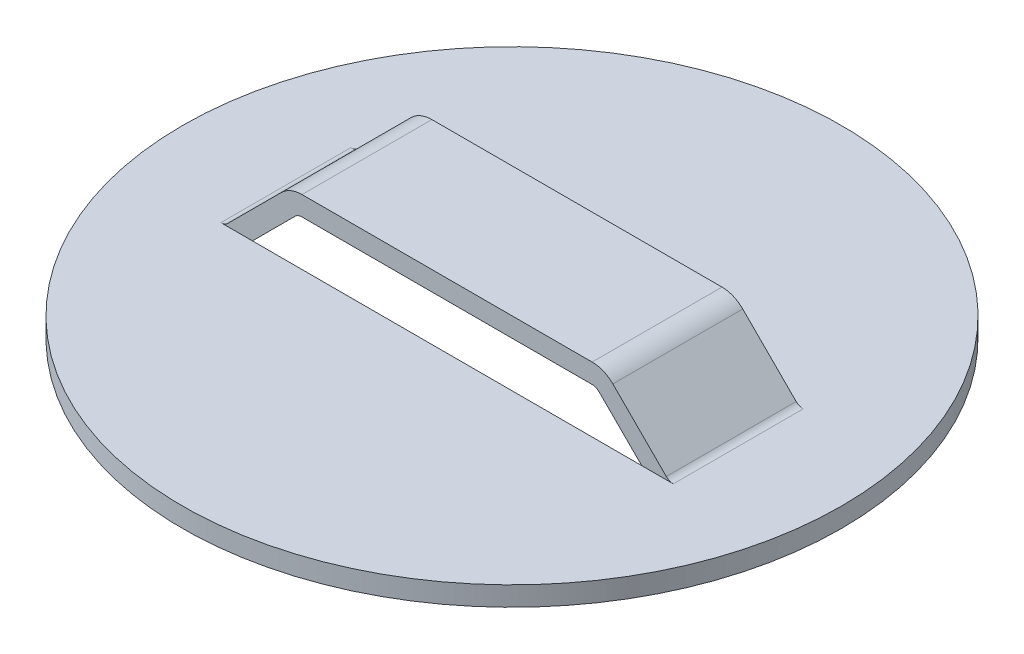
ISO-10303-21;
HEADER;
FILE_DESCRIPTION(('STEP AP214'),'2;1');
FILE_NAME('part.step','',(''),(''),'','','');
FILE_SCHEMA(('AUTOMOTIVE_DESIGN { 1 0 10303 214 1 1 1 1 }'));
ENDSEC;
DATA;
#1=APPLICATION_CONTEXT('core data for automotive mechanical design processes');
#2=APPLICATION_PROTOCOL_DEFINITION('international standard','automotive_design',2000,#1);
#3=PRODUCT_CONTEXT('',#1,'mechanical');
#4=PRODUCT('Part','Part','',(#3));
#5=PRODUCT_RELATED_PRODUCT_CATEGORY('part','',(#4));
#6=PRODUCT_DEFINITION_FORMATION('','',#4);
#7=PRODUCT_DEFINITION_CONTEXT('part definition',#1,'design');
#8=PRODUCT_DEFINITION('design','',#6,#7);
#9=PRODUCT_DEFINITION_SHAPE('','',#8);
#10=(LENGTH_UNIT() NAMED_UNIT(*) SI_UNIT(.MILLI.,.METRE.));
#11=(NAMED_UNIT(*) PLANE_ANGLE_UNIT() SI_UNIT($,.RADIAN.));
#12=(NAMED_UNIT(*) SI_UNIT($,.STERADIAN.) SOLID_ANGLE_UNIT());
#13=UNCERTAINTY_MEASURE_WITH_UNIT(LENGTH_MEASURE(1.E-05),#10,'distance_accuracy_value','');
#14=(GEOMETRIC_REPRESENTATION_CONTEXT(3) GLOBAL_UNCERTAINTY_ASSIGNED_CONTEXT((#13)) GLOBAL_UNIT_ASSIGNED_CONTEXT((#10,
#11,#12)) REPRESENTATION_CONTEXT('',''));
#15=CARTESIAN_POINT('',(0.,0.,0.));
#16=DIRECTION('',(0.,0.,1.));
#17=DIRECTION('',(1.,0.,0.));
#18=AXIS2_PLACEMENT_3D('',#15,#16,#17);
#19=CARTESIAN_POINT('',(-17.4352307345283,0.762,0.));
#20=DIRECTION('',(0.,0.,-1.));
#21=DIRECTION('',(-1.,0.,0.));
#22=AXIS2_PLACEMENT_3D('',#19,#20,#21);
#23=PLANE('',#22);
#24=DIRECTION('',(-1.,0.,0.));
#25=VECTOR('',#24,1.);
#26=CARTESIAN_POINT('',(-17.4352307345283,0.,0.));
#27=LINE('',#26,#25);
#28=CARTESIAN_POINT('',(17.4352307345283,0.,0.));
#29=VERTEX_POINT('',#28);
#30=CARTESIAN_POINT('',(15.0002595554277,0.,0.));
#31=VERTEX_POINT('',#30);
#32=EDGE_CURVE('E165',#29,#31,#27,.T.);
#33=ORIENTED_EDGE('',*,*,#32,.F.);
#34=CARTESIAN_POINT('',(17.4352307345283,0.762,0.));
#35=DIRECTION('',(0.,0.,1.));
#36=DIRECTION('',(1.,0.,0.));
#37=AXIS2_PLACEMENT_3D('',#34,#35,#36);
#38=CIRCLE('',#37,0.761999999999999);
#39=CARTESIAN_POINT('',(16.8964153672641,0.223184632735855,0.));
#40=VERTEX_POINT('',#39);
#41=EDGE_CURVE('E167',#40,#29,#38,.T.);
#42=ORIENTED_EDGE('',*,*,#41,.F.);
#43=DIRECTION('',(0.707106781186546,-0.707106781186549,0.));
#44=VECTOR('',#43,1.);
#45=CARTESIAN_POINT('',(12.7779144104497,4.34168558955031,0.));
#46=LINE('',#45,#44);
#47=CARTESIAN_POINT('',(12.7779144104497,4.34168558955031,0.));
#48=VERTEX_POINT('',#47);
#49=EDGE_CURVE('E185',#48,#40,#46,.T.);
#50=ORIENTED_EDGE('',*,*,#49,.F.);
#51=CARTESIAN_POINT('',(11.1794288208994,2.7432,0.));
#52=DIRECTION('',(0.,0.,1.));
#53=DIRECTION('',(1.,0.,0.));
#54=AXIS2_PLACEMENT_3D('',#51,#52,#53);
#55=CIRCLE('',#54,2.2606);
#56=CARTESIAN_POINT('',(11.1794288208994,5.0038,0.));
#57=VERTEX_POINT('',#56);
#58=EDGE_CURVE('E201',#57,#48,#55,.F.);
#59=ORIENTED_EDGE('',*,*,#58,.F.);
#60=DIRECTION('',(1.,0.,0.));
#61=VECTOR('',#60,1.);
#62=CARTESIAN_POINT('',(-11.1794288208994,5.0038,0.));
#63=LINE('',#62,#61);
#64=CARTESIAN_POINT('',(-11.1794288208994,5.0038,0.));
#65=VERTEX_POINT('',#64);
#66=EDGE_CURVE('E270',#65,#57,#63,.T.);
#67=ORIENTED_EDGE('',*,*,#66,.F.);
#68=CARTESIAN_POINT('',(-11.1794288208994,2.7432,0.));
#69=DIRECTION('',(0.,0.,1.));
#70=DIRECTION('',(1.,0.,0.));
#71=AXIS2_PLACEMENT_3D('',#68,#69,#70);
#72=CIRCLE('',#71,2.2606);
#73=CARTESIAN_POINT('',(-12.7779144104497,4.34168558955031,0.));
#74=VERTEX_POINT('',#73);
#75=EDGE_CURVE('E214',#74,#65,#72,.F.);
#76=ORIENTED_EDGE('',*,*,#75,.F.);
#77=DIRECTION('',(0.707106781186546,0.707106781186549,0.));
#78=VECTOR('',#77,1.);
#79=CARTESIAN_POINT('',(-16.8964153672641,0.223184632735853,0.));
#80=LINE('',#79,#78);
#81=CARTESIAN_POINT('',(-16.8964153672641,0.223184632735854,0.));
#82=VERTEX_POINT('',#81);
#83=EDGE_CURVE('E256',#82,#74,#80,.T.);
#84=ORIENTED_EDGE('',*,*,#83,.F.);
#85=CARTESIAN_POINT('',(-17.4352307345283,0.762,0.));
#86=DIRECTION('',(0.,0.,1.));
#87=DIRECTION('',(1.,0.,0.));
#88=AXIS2_PLACEMENT_3D('',#85,#86,#87);
#89=CIRCLE('',#88,0.761999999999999);
#90=CARTESIAN_POINT('',(-17.4352307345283,0.,0.));
#91=VERTEX_POINT('',#90);
#92=EDGE_CURVE('E205',#91,#82,#89,.T.);
#93=ORIENTED_EDGE('',*,*,#92,.F.);
#94=CARTESIAN_POINT('',(-15.0002595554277,0.,0.));
#95=VERTEX_POINT('',#94);
#96=EDGE_CURVE('E177',#95,#91,#27,.T.);
#97=ORIENTED_EDGE('',*,*,#96,.F.);
#98=DIRECTION('',(-0.707106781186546,-0.707106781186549,0.));
#99=VECTOR('',#98,1.);
#100=CARTESIAN_POINT('',(-11.7182441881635,3.28201536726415,0.));
#101=LINE('',#100,#99);
#102=CARTESIAN_POINT('',(-11.7182441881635,3.28201536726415,0.));
#103=VERTEX_POINT('',#102);
#104=EDGE_CURVE('E247',#103,#95,#101,.T.);
#105=ORIENTED_EDGE('',*,*,#104,.F.);
#106=CARTESIAN_POINT('',(-11.1794288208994,2.7432,0.));
#107=DIRECTION('',(0.,0.,1.));
#108=DIRECTION('',(1.,0.,0.));
#109=AXIS2_PLACEMENT_3D('',#106,#107,#108);
#110=CIRCLE('',#109,0.761999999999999);
#111=CARTESIAN_POINT('',(-11.1794288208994,3.5052,0.));
#112=VERTEX_POINT('',#111);
#113=EDGE_CURVE('E248',#112,#103,#110,.T.);
#114=ORIENTED_EDGE('',*,*,#113,.F.);
#115=DIRECTION('',(-1.,0.,0.));
#116=VECTOR('',#115,1.);
#117=CARTESIAN_POINT('',(-17.4352307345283,3.5052,0.));
#118=LINE('',#117,#116);
#119=CARTESIAN_POINT('',(11.1794288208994,3.5052,0.));
#120=VERTEX_POINT('',#119);
#121=EDGE_CURVE('E251',#120,#112,#118,.T.);
#122=ORIENTED_EDGE('',*,*,#121,.F.);
#123=CARTESIAN_POINT('',(11.1794288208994,2.7432,0.));
#124=DIRECTION('',(0.,0.,1.));
#125=DIRECTION('',(1.,0.,0.));
#126=AXIS2_PLACEMENT_3D('',#123,#124,#125);
#127=CIRCLE('',#126,0.761999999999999);
#128=CARTESIAN_POINT('',(11.7182441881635,3.28201536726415,0.));
#129=VERTEX_POINT('',#128);
#130=EDGE_CURVE('E252',#129,#120,#127,.T.);
#131=ORIENTED_EDGE('',*,*,#130,.F.);
#132=DIRECTION('',(-0.707106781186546,0.707106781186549,0.));
#133=VECTOR('',#132,1.);
#134=CARTESIAN_POINT('',(15.836745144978,-0.836485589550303,0.));
#135=LINE('',#134,#133);
#136=EDGE_CURVE('E169',#31,#129,#135,.T.);
#137=ORIENTED_EDGE('',*,*,#136,.F.);
#138=EDGE_LOOP('',(#33,#42,#50,#59,#67,#76,#84,#93,#97,#105,#114,#122,#131,#137));
#139=FACE_BOUND('',#138,.T.);
#140=ADVANCED_FACE('F39',(#139),#23,.F.);
#141=CARTESIAN_POINT('',(-17.4352307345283,0.762,-10.0076));
#142=DIRECTION('',(0.,0.,-1.));
#143=DIRECTION('',(-1.,0.,0.));
#144=AXIS2_PLACEMENT_3D('',#141,#142,#143);
#145=PLANE('',#144);
#146=CARTESIAN_POINT('',(17.4352307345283,0.762,-10.0076));
#147=DIRECTION('',(0.,0.,1.));
#148=DIRECTION('',(1.,0.,0.));
#149=AXIS2_PLACEMENT_3D('',#146,#147,#148);
#150=CIRCLE('',#149,0.761999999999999);
#151=CARTESIAN_POINT('',(16.8964153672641,0.223184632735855,-10.0076));
#152=VERTEX_POINT('',#151);
#153=CARTESIAN_POINT('',(17.4352307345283,0.,-10.0076));
#154=VERTEX_POINT('',#153);
#155=EDGE_CURVE('E233',#152,#154,#150,.T.);
#156=ORIENTED_EDGE('',*,*,#155,.T.);
#157=DIRECTION('',(-1.,0.,0.));
#158=VECTOR('',#157,1.);
#159=CARTESIAN_POINT('',(-17.4352307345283,0.,-10.0076));
#160=LINE('',#159,#158);
#161=CARTESIAN_POINT('',(15.0002595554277,0.,-10.0076));
#162=VERTEX_POINT('',#161);
#163=EDGE_CURVE('E11',#154,#162,#160,.T.);
#164=ORIENTED_EDGE('',*,*,#163,.T.);
#165=DIRECTION('',(-0.707106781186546,0.707106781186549,0.));
#166=VECTOR('',#165,1.);
#167=CARTESIAN_POINT('',(15.836745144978,-0.836485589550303,-10.0076));
#168=LINE('',#167,#166);
#169=CARTESIAN_POINT('',(11.7182441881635,3.28201536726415,-10.0076));
#170=VERTEX_POINT('',#169);
#171=EDGE_CURVE('E232',#162,#170,#168,.T.);
#172=ORIENTED_EDGE('',*,*,#171,.T.);
#173=CARTESIAN_POINT('',(11.1794288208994,2.7432,-10.0076));
#174=DIRECTION('',(0.,0.,1.));
#175=DIRECTION('',(1.,0.,0.));
#176=AXIS2_PLACEMENT_3D('',#173,#174,#175);
#177=CIRCLE('',#176,0.761999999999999);
#178=CARTESIAN_POINT('',(11.1794288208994,3.5052,-10.0076));
#179=VERTEX_POINT('',#178);
#180=EDGE_CURVE('E225',#170,#179,#177,.T.);
#181=ORIENTED_EDGE('',*,*,#180,.T.);
#182=DIRECTION('',(-1.,0.,0.));
#183=VECTOR('',#182,1.);
#184=CARTESIAN_POINT('',(-17.4352307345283,3.5052,-10.0076));
#185=LINE('',#184,#183);
#186=CARTESIAN_POINT('',(-11.1794288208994,3.5052,-10.0076));
#187=VERTEX_POINT('',#186);
#188=EDGE_CURVE('E224',#179,#187,#185,.T.);
#189=ORIENTED_EDGE('',*,*,#188,.T.);
#190=CARTESIAN_POINT('',(-11.1794288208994,2.7432,-10.0076));
#191=DIRECTION('',(0.,0.,1.));
#192=DIRECTION('',(1.,0.,0.));
#193=AXIS2_PLACEMENT_3D('',#190,#191,#192);
#194=CIRCLE('',#193,0.761999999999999);
#195=CARTESIAN_POINT('',(-11.7182441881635,3.28201536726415,-10.0076));
#196=VERTEX_POINT('',#195);
#197=EDGE_CURVE('E221',#187,#196,#194,.T.);
#198=ORIENTED_EDGE('',*,*,#197,.T.);
#199=DIRECTION('',(-0.707106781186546,-0.707106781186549,0.));
#200=VECTOR('',#199,1.);
#201=CARTESIAN_POINT('',(-11.7182441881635,3.28201536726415,-10.0076));
#202=LINE('',#201,#200);
#203=CARTESIAN_POINT('',(-15.0002595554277,0.,-10.0076));
#204=VERTEX_POINT('',#203);
#205=EDGE_CURVE('E220',#196,#204,#202,.T.);
#206=ORIENTED_EDGE('',*,*,#205,.T.);
#207=DIRECTION('',(1.,0.,0.));
#208=VECTOR('',#207,1.);
#209=CARTESIAN_POINT('',(-17.4352307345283,0.,-10.0076));
#210=LINE('',#209,#208);
#211=CARTESIAN_POINT('',(-17.4352307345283,0.,-10.0076));
#212=VERTEX_POINT('',#211);
#213=EDGE_CURVE('E322',#212,#204,#210,.T.);
#214=ORIENTED_EDGE('',*,*,#213,.F.);
#215=CARTESIAN_POINT('',(-17.4352307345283,0.762,-10.0076));
#216=DIRECTION('',(0.,0.,1.));
#217=DIRECTION('',(1.,0.,0.));
#218=AXIS2_PLACEMENT_3D('',#215,#216,#217);
#219=CIRCLE('',#218,0.761999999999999);
#220=CARTESIAN_POINT('',(-16.8964153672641,0.223184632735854,-10.0076));
#221=VERTEX_POINT('',#220);
#222=EDGE_CURVE('E200',#212,#221,#219,.T.);
#223=ORIENTED_EDGE('',*,*,#222,.T.);
#224=DIRECTION('',(0.707106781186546,0.707106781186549,0.));
#225=VECTOR('',#224,1.);
#226=CARTESIAN_POINT('',(-16.8964153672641,0.223184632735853,-10.0076));
#227=LINE('',#226,#225);
#228=CARTESIAN_POINT('',(-12.7779144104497,4.34168558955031,-10.0076));
#229=VERTEX_POINT('',#228);
#230=EDGE_CURVE('E239',#221,#229,#227,.T.);
#231=ORIENTED_EDGE('',*,*,#230,.T.);
#232=CARTESIAN_POINT('',(-11.1794288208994,2.7432,-10.0076));
#233=DIRECTION('',(0.,0.,1.));
#234=DIRECTION('',(1.,0.,0.));
#235=AXIS2_PLACEMENT_3D('',#232,#233,#234);
#236=CIRCLE('',#235,2.2606);
#237=CARTESIAN_POINT('',(-11.1794288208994,5.0038,-10.0076));
#238=VERTEX_POINT('',#237);
#239=EDGE_CURVE('E210',#238,#229,#236,.T.);
#240=ORIENTED_EDGE('',*,*,#239,.F.);
#241=DIRECTION('',(1.,0.,0.));
#242=VECTOR('',#241,1.);
#243=CARTESIAN_POINT('',(-11.1794288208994,5.0038,-10.0076));
#244=LINE('',#243,#242);
#245=CARTESIAN_POINT('',(11.1794288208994,5.0038,-10.0076));
#246=VERTEX_POINT('',#245);
#247=EDGE_CURVE('E307',#246,#238,#244,.F.);
#248=ORIENTED_EDGE('',*,*,#247,.F.);
#249=CARTESIAN_POINT('',(11.1794288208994,2.7432,-10.0076));
#250=DIRECTION('',(0.,0.,1.));
#251=DIRECTION('',(1.,0.,0.));
#252=AXIS2_PLACEMENT_3D('',#249,#250,#251);
#253=CIRCLE('',#252,2.2606);
#254=CARTESIAN_POINT('',(12.7779144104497,4.34168558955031,-10.0076));
#255=VERTEX_POINT('',#254);
#256=EDGE_CURVE('E236',#246,#255,#253,.F.);
#257=ORIENTED_EDGE('',*,*,#256,.T.);
#258=DIRECTION('',(0.707106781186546,-0.707106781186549,0.));
#259=VECTOR('',#258,1.);
#260=CARTESIAN_POINT('',(12.7779144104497,4.34168558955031,-10.0076));
#261=LINE('',#260,#259);
#262=EDGE_CURVE('E235',#255,#152,#261,.T.);
#263=ORIENTED_EDGE('',*,*,#262,.T.);
#264=EDGE_LOOP('',(#156,#164,#172,#181,#189,#198,#206,#214,#223,#231,#240,#248,#257,#263));
#265=FACE_BOUND('',#264,.T.);
#266=ADVANCED_FACE('F347',(#265),#145,.T.);
#267=CARTESIAN_POINT('',(-17.4352307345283,0.762,-10.0076));
#268=DIRECTION('',(0.,0.,1.));
#269=DIRECTION('',(1.,0.,0.));
#270=AXIS2_PLACEMENT_3D('',#267,#268,#269);
#271=CYLINDRICAL_SURFACE('',#270,0.761999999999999);
#272=DIRECTION('',(0.,0.,1.));
#273=VECTOR('',#272,1.);
#274=CARTESIAN_POINT('',(-16.8964153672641,0.223184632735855,-10.0076));
#275=LINE('',#274,#273);
#276=EDGE_CURVE('E202',#221,#82,#275,.T.);
#277=ORIENTED_EDGE('',*,*,#276,.F.);
#278=ORIENTED_EDGE('',*,*,#222,.F.);
#279=DIRECTION('',(0.,0.,1.));
#280=VECTOR('',#279,1.);
#281=CARTESIAN_POINT('',(-17.4352307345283,0.,-10.0076));
#282=LINE('',#281,#280);
#283=EDGE_CURVE('E194',#91,#212,#282,.F.);
#284=ORIENTED_EDGE('',*,*,#283,.F.);
#285=ORIENTED_EDGE('',*,*,#92,.T.);
#286=EDGE_LOOP('',(#277,#278,#284,#285));
#287=FACE_BOUND('',#286,.T.);
#288=ADVANCED_FACE('F41',(#287),#271,.F.);
#289=CARTESIAN_POINT('',(12.7779144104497,4.34168558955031,-10.0076));
#290=DIRECTION('',(0.707106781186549,0.707106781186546,0.));
#291=DIRECTION('',(-0.707106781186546,0.707106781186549,0.));
#292=AXIS2_PLACEMENT_3D('',#289,#290,#291);
#293=PLANE('',#292);
#294=ORIENTED_EDGE('',*,*,#262,.F.);
#295=DIRECTION('',(0.,0.,1.));
#296=VECTOR('',#295,1.);
#297=CARTESIAN_POINT('',(12.7779144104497,4.34168558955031,-10.0076));
#298=LINE('',#297,#296);
#299=EDGE_CURVE('E198',#48,#255,#298,.F.);
#300=ORIENTED_EDGE('',*,*,#299,.F.);
#301=ORIENTED_EDGE('',*,*,#49,.T.);
#302=DIRECTION('',(0.,0.,1.));
#303=VECTOR('',#302,1.);
#304=CARTESIAN_POINT('',(16.8964153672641,0.223184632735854,-10.0076));
#305=LINE('',#304,#303);
#306=EDGE_CURVE('E183',#40,#152,#305,.F.);
#307=ORIENTED_EDGE('',*,*,#306,.T.);
#308=EDGE_LOOP('',(#294,#300,#301,#307));
#309=FACE_BOUND('',#308,.T.);
#310=ADVANCED_FACE('F502',(#309),#293,.T.);
#311=CARTESIAN_POINT('',(17.4352307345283,0.762,-10.0076));
#312=DIRECTION('',(0.,0.,1.));
#313=DIRECTION('',(1.,0.,0.));
#314=AXIS2_PLACEMENT_3D('',#311,#312,#313);
#315=CYLINDRICAL_SURFACE('',#314,0.761999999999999);
#316=DIRECTION('',(0.,0.,1.));
#317=VECTOR('',#316,1.);
#318=CARTESIAN_POINT('',(17.4352307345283,0.,-10.0076));
#319=LINE('',#318,#317);
#320=EDGE_CURVE('E182',#154,#29,#319,.T.);
#321=ORIENTED_EDGE('',*,*,#320,.F.);
#322=ORIENTED_EDGE('',*,*,#155,.F.);
#323=ORIENTED_EDGE('',*,*,#306,.F.);
#324=ORIENTED_EDGE('',*,*,#41,.T.);
#325=EDGE_LOOP('',(#321,#322,#323,#324));
#326=FACE_BOUND('',#325,.T.);
#327=ADVANCED_FACE('F180',(#326),#315,.F.);
#328=CARTESIAN_POINT('',(17.4352307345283,0.,-10.0076));
#329=DIRECTION('',(0.,1.,0.));
#330=DIRECTION('',(0.,0.,1.));
#331=AXIS2_PLACEMENT_3D('',#328,#329,#330);
#332=PLANE('',#331);
#333=CARTESIAN_POINT('',(0.,0.,-5.0038));
#334=DIRECTION('',(0.,-1.,0.));
#335=DIRECTION('',(1.,0.,0.));
#336=AXIS2_PLACEMENT_3D('',#333,#334,#335);
#337=CIRCLE('',#336,25.4);
#338=CARTESIAN_POINT('',(25.4,0.,-5.0038));
#339=VERTEX_POINT('',#338);
#340=EDGE_CURVE('E209',#339,#339,#337,.T.);
#341=ORIENTED_EDGE('',*,*,#340,.F.);
#342=EDGE_LOOP('',(#341));
#343=FACE_BOUND('',#342,.T.);
#344=ORIENTED_EDGE('',*,*,#320,.T.);
#345=ORIENTED_EDGE('',*,*,#32,.T.);
#346=EDGE_CURVE('E175',#31,#95,#27,.T.);
#347=ORIENTED_EDGE('',*,*,#346,.T.);
#348=ORIENTED_EDGE('',*,*,#96,.T.);
#349=ORIENTED_EDGE('',*,*,#283,.T.);
#350=ORIENTED_EDGE('',*,*,#213,.T.);
#351=EDGE_CURVE('E174',#204,#162,#210,.T.);
#352=ORIENTED_EDGE('',*,*,#351,.T.);
#353=ORIENTED_EDGE('',*,*,#163,.F.);
#354=EDGE_LOOP('',(#344,#345,#347,#348,#349,#350,#352,#353));
#355=FACE_BOUND('',#354,.T.);
#356=ADVANCED_FACE('F187',(#343,#355),#332,.T.);
#357=CARTESIAN_POINT('',(17.4352307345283,0.762,-10.0076));
#358=DIRECTION('',(0.,0.,1.));
#359=DIRECTION('',(1.,0.,0.));
#360=AXIS2_PLACEMENT_3D('',#357,#358,#359);
#361=CYLINDRICAL_SURFACE('',#360,2.2606);
#362=CARTESIAN_POINT('',(17.4352307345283,0.762,-10.0076));
#363=DIRECTION('',(0.,0.,1.));
#364=DIRECTION('',(1.,0.,0.));
#365=AXIS2_PLACEMENT_3D('',#362,#363,#364);
#366=CIRCLE('',#365,2.2606);
#367=CARTESIAN_POINT('',(17.4352307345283,-1.4986,-10.0076));
#368=VERTEX_POINT('',#367);
#369=CARTESIAN_POINT('',(15.836745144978,-0.836485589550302,-10.0076));
#370=VERTEX_POINT('',#369);
#371=EDGE_CURVE('E229',#368,#370,#366,.F.);
#372=ORIENTED_EDGE('',*,*,#371,.F.);
#373=DIRECTION('',(0.,0.,1.));
#374=VECTOR('',#373,1.);
#375=CARTESIAN_POINT('',(17.4352307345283,-1.4986,-10.0076));
#376=LINE('',#375,#374);
#377=CARTESIAN_POINT('',(17.4352307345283,-1.4986,0.));
#378=VERTEX_POINT('',#377);
#379=EDGE_CURVE('E189',#368,#378,#376,.T.);
#380=ORIENTED_EDGE('',*,*,#379,.T.);
#381=CARTESIAN_POINT('',(17.4352307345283,0.762,0.));
#382=DIRECTION('',(0.,0.,1.));
#383=DIRECTION('',(1.,0.,0.));
#384=AXIS2_PLACEMENT_3D('',#381,#382,#383);
#385=CIRCLE('',#384,2.2606);
#386=CARTESIAN_POINT('',(15.836745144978,-0.836485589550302,0.));
#387=VERTEX_POINT('',#386);
#388=EDGE_CURVE('E184',#378,#387,#385,.F.);
#389=ORIENTED_EDGE('',*,*,#388,.T.);
#390=DIRECTION('',(0.,0.,1.));
#391=VECTOR('',#390,1.);
#392=CARTESIAN_POINT('',(15.836745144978,-0.836485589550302,-10.0076));
#393=LINE('',#392,#391);
#394=EDGE_CURVE('E192',#370,#387,#393,.T.);
#395=ORIENTED_EDGE('',*,*,#394,.F.);
#396=EDGE_LOOP('',(#372,#380,#389,#395));
#397=FACE_BOUND('',#396,.T.);
#398=ADVANCED_FACE('F292',(#397),#361,.T.);
#399=CARTESIAN_POINT('',(11.7182441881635,3.28201536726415,-10.0076));
#400=DIRECTION('',(-0.707106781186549,-0.707106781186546,0.));
#401=DIRECTION('',(0.707106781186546,-0.707106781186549,0.));
#402=AXIS2_PLACEMENT_3D('',#399,#400,#401);
#403=PLANE('',#402);
#404=EDGE_CURVE('E228',#370,#162,#168,.T.);
#405=ORIENTED_EDGE('',*,*,#404,.F.);
#406=ORIENTED_EDGE('',*,*,#394,.T.);
#407=EDGE_CURVE('E254',#387,#31,#135,.T.);
#408=ORIENTED_EDGE('',*,*,#407,.T.);
#409=ORIENTED_EDGE('',*,*,#136,.T.);
#410=DIRECTION('',(0.,0.,1.));
#411=VECTOR('',#410,1.);
#412=CARTESIAN_POINT('',(11.7182441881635,3.28201536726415,-10.0076));
#413=LINE('',#412,#411);
#414=EDGE_CURVE('E284',#129,#170,#413,.F.);
#415=ORIENTED_EDGE('',*,*,#414,.T.);
#416=ORIENTED_EDGE('',*,*,#171,.F.);
#417=EDGE_LOOP('',(#405,#406,#408,#409,#415,#416));
#418=FACE_BOUND('',#417,.T.);
#419=ADVANCED_FACE('F289',(#418),#403,.T.);
#420=CARTESIAN_POINT('',(11.1794288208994,2.7432,-10.0076));
#421=DIRECTION('',(0.,0.,1.));
#422=DIRECTION('',(1.,0.,0.));
#423=AXIS2_PLACEMENT_3D('',#420,#421,#422);
#424=CYLINDRICAL_SURFACE('',#423,0.761999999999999);
#425=DIRECTION('',(0.,0.,-1.));
#426=VECTOR('',#425,1.);
#427=CARTESIAN_POINT('',(11.1794288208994,3.5052,-10.0076));
#428=LINE('',#427,#426);
#429=EDGE_CURVE('E281',#179,#120,#428,.F.);
#430=ORIENTED_EDGE('',*,*,#429,.F.);
#431=ORIENTED_EDGE('',*,*,#180,.F.);
#432=ORIENTED_EDGE('',*,*,#414,.F.);
#433=ORIENTED_EDGE('',*,*,#130,.T.);
#434=EDGE_LOOP('',(#430,#431,#432,#433));
#435=FACE_BOUND('',#434,.T.);
#436=ADVANCED_FACE('F357',(#435),#424,.F.);
#437=CARTESIAN_POINT('',(-11.1794288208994,3.5052,-10.0076));
#438=DIRECTION('',(0.,-1.,0.));
#439=DIRECTION('',(0.,0.,-1.));
#440=AXIS2_PLACEMENT_3D('',#437,#438,#439);
#441=PLANE('',#440);
#442=ORIENTED_EDGE('',*,*,#188,.F.);
#443=ORIENTED_EDGE('',*,*,#429,.T.);
#444=ORIENTED_EDGE('',*,*,#121,.T.);
#445=DIRECTION('',(0.,0.,1.));
#446=VECTOR('',#445,1.);
#447=CARTESIAN_POINT('',(-11.1794288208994,3.5052,-10.0076));
#448=LINE('',#447,#446);
#449=EDGE_CURVE('E279',#112,#187,#448,.F.);
#450=ORIENTED_EDGE('',*,*,#449,.T.);
#451=EDGE_LOOP('',(#442,#443,#444,#450));
#452=FACE_BOUND('',#451,.T.);
#453=ADVANCED_FACE('F354',(#452),#441,.T.);
#454=CARTESIAN_POINT('',(-11.1794288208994,2.7432,-10.0076));
#455=DIRECTION('',(0.,0.,1.));
#456=DIRECTION('',(1.,0.,0.));
#457=AXIS2_PLACEMENT_3D('',#454,#455,#456);
#458=CYLINDRICAL_SURFACE('',#457,0.761999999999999);
#459=DIRECTION('',(0.,0.,1.));
#460=VECTOR('',#459,1.);
#461=CARTESIAN_POINT('',(-11.7182441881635,3.28201536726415,-10.0076));
#462=LINE('',#461,#460);
#463=EDGE_CURVE('E276',#196,#103,#462,.T.);
#464=ORIENTED_EDGE('',*,*,#463,.F.);
#465=ORIENTED_EDGE('',*,*,#197,.F.);
#466=ORIENTED_EDGE('',*,*,#449,.F.);
#467=ORIENTED_EDGE('',*,*,#113,.T.);
#468=EDGE_LOOP('',(#464,#465,#466,#467));
#469=FACE_BOUND('',#468,.T.);
#470=ADVANCED_FACE('F352',(#469),#458,.F.);
#471=CARTESIAN_POINT('',(-15.836745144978,-0.836485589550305,-10.0076));
#472=DIRECTION('',(0.70710678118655,-0.707106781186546,0.));
#473=DIRECTION('',(0.707106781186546,0.70710678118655,0.));
#474=AXIS2_PLACEMENT_3D('',#471,#472,#473);
#475=PLANE('',#474);
#476=ORIENTED_EDGE('',*,*,#205,.F.);
#477=ORIENTED_EDGE('',*,*,#463,.T.);
#478=ORIENTED_EDGE('',*,*,#104,.T.);
#479=CARTESIAN_POINT('',(-15.836745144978,-0.836485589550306,0.));
#480=VERTEX_POINT('',#479);
#481=EDGE_CURVE('E250',#95,#480,#101,.T.);
#482=ORIENTED_EDGE('',*,*,#481,.T.);
#483=DIRECTION('',(0.,0.,1.));
#484=VECTOR('',#483,1.);
#485=CARTESIAN_POINT('',(-15.836745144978,-0.836485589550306,-10.0076));
#486=LINE('',#485,#484);
#487=CARTESIAN_POINT('',(-15.836745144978,-0.836485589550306,-10.0076));
#488=VERTEX_POINT('',#487);
#489=EDGE_CURVE('E273',#488,#480,#486,.T.);
#490=ORIENTED_EDGE('',*,*,#489,.F.);
#491=EDGE_CURVE('E54',#204,#488,#202,.T.);
#492=ORIENTED_EDGE('',*,*,#491,.F.);
#493=EDGE_LOOP('',(#476,#477,#478,#482,#490,#492));
#494=FACE_BOUND('',#493,.T.);
#495=ADVANCED_FACE('F340',(#494),#475,.T.);
#496=CARTESIAN_POINT('',(-17.4352307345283,0.762,-10.0076));
#497=DIRECTION('',(0.,0.,1.));
#498=DIRECTION('',(1.,0.,0.));
#499=AXIS2_PLACEMENT_3D('',#496,#497,#498);
#500=CYLINDRICAL_SURFACE('',#499,2.2606);
#501=CARTESIAN_POINT('',(-17.4352307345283,0.762,-10.0076));
#502=DIRECTION('',(0.,0.,1.));
#503=DIRECTION('',(1.,0.,0.));
#504=AXIS2_PLACEMENT_3D('',#501,#502,#503);
#505=CIRCLE('',#504,2.2606);
#506=CARTESIAN_POINT('',(-17.4352307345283,-1.4986,-10.0076));
#507=VERTEX_POINT('',#506);
#508=EDGE_CURVE('E217',#488,#507,#505,.F.);
#509=ORIENTED_EDGE('',*,*,#508,.F.);
#510=ORIENTED_EDGE('',*,*,#489,.T.);
#511=CARTESIAN_POINT('',(-17.4352307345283,0.762,0.));
#512=DIRECTION('',(0.,0.,1.));
#513=DIRECTION('',(1.,0.,0.));
#514=AXIS2_PLACEMENT_3D('',#511,#512,#513);
#515=CIRCLE('',#514,2.2606);
#516=CARTESIAN_POINT('',(-17.4352307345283,-1.4986,0.));
#517=VERTEX_POINT('',#516);
#518=EDGE_CURVE('E244',#480,#517,#515,.F.);
#519=ORIENTED_EDGE('',*,*,#518,.T.);
#520=DIRECTION('',(0.,0.,-1.));
#521=VECTOR('',#520,1.);
#522=CARTESIAN_POINT('',(-17.4352307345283,-1.4986,-10.0076));
#523=LINE('',#522,#521);
#524=EDGE_CURVE('E206',#507,#517,#523,.F.);
#525=ORIENTED_EDGE('',*,*,#524,.F.);
#526=EDGE_LOOP('',(#509,#510,#519,#525));
#527=FACE_BOUND('',#526,.T.);
#528=ADVANCED_FACE('F338',(#527),#500,.T.);
#529=CARTESIAN_POINT('',(-25.4,-1.4986,-10.0076));
#530=DIRECTION('',(0.,-1.,0.));
#531=DIRECTION('',(0.,0.,-1.));
#532=AXIS2_PLACEMENT_3D('',#529,#530,#531);
#533=PLANE('',#532);
#534=CARTESIAN_POINT('',(0.,-1.4986,-5.0038));
#535=DIRECTION('',(0.,-1.,0.));
#536=DIRECTION('',(1.,0.,0.));
#537=AXIS2_PLACEMENT_3D('',#534,#535,#536);
#538=CIRCLE('',#537,25.4);
#539=CARTESIAN_POINT('',(25.4,-1.4986,-5.0038));
#540=VERTEX_POINT('',#539);
#541=EDGE_CURVE('E319',#540,#540,#538,.T.);
#542=ORIENTED_EDGE('',*,*,#541,.T.);
#543=EDGE_LOOP('',(#542));
#544=FACE_BOUND('',#543,.T.);
#545=DIRECTION('',(-1.,0.,0.));
#546=VECTOR('',#545,1.);
#547=CARTESIAN_POINT('',(-17.4352307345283,-1.4986,0.));
#548=LINE('',#547,#546);
#549=EDGE_CURVE('E297',#378,#517,#548,.T.);
#550=ORIENTED_EDGE('',*,*,#549,.F.);
#551=ORIENTED_EDGE('',*,*,#379,.F.);
#552=DIRECTION('',(1.,0.,0.));
#553=VECTOR('',#552,1.);
#554=CARTESIAN_POINT('',(-17.4352307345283,-1.4986,-10.0076));
#555=LINE('',#554,#553);
#556=EDGE_CURVE('E325',#507,#368,#555,.T.);
#557=ORIENTED_EDGE('',*,*,#556,.F.);
#558=ORIENTED_EDGE('',*,*,#524,.T.);
#559=EDGE_LOOP('',(#550,#551,#557,#558));
#560=FACE_BOUND('',#559,.T.);
#561=ADVANCED_FACE('F336',(#544,#560),#533,.T.);
#562=CARTESIAN_POINT('',(-16.8964153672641,0.223184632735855,-10.0076));
#563=DIRECTION('',(-0.707106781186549,0.707106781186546,0.));
#564=DIRECTION('',(-0.707106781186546,-0.707106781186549,0.));
#565=AXIS2_PLACEMENT_3D('',#562,#563,#564);
#566=PLANE('',#565);
#567=ORIENTED_EDGE('',*,*,#230,.F.);
#568=ORIENTED_EDGE('',*,*,#276,.T.);
#569=ORIENTED_EDGE('',*,*,#83,.T.);
#570=DIRECTION('',(0.,0.,1.));
#571=VECTOR('',#570,1.);
#572=CARTESIAN_POINT('',(-12.7779144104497,4.34168558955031,-10.0076));
#573=LINE('',#572,#571);
#574=EDGE_CURVE('E213',#229,#74,#573,.T.);
#575=ORIENTED_EDGE('',*,*,#574,.F.);
#576=EDGE_LOOP('',(#567,#568,#569,#575));
#577=FACE_BOUND('',#576,.T.);
#578=ADVANCED_FACE('F377',(#577),#566,.T.);
#579=CARTESIAN_POINT('',(11.1794288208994,2.7432,-10.0076));
#580=DIRECTION('',(0.,0.,1.));
#581=DIRECTION('',(1.,0.,0.));
#582=AXIS2_PLACEMENT_3D('',#579,#580,#581);
#583=CYLINDRICAL_SURFACE('',#582,2.2606);
#584=ORIENTED_EDGE('',*,*,#256,.F.);
#585=DIRECTION('',(0.,0.,1.));
#586=VECTOR('',#585,1.);
#587=CARTESIAN_POINT('',(11.1794288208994,5.0038,-10.0076));
#588=LINE('',#587,#586);
#589=EDGE_CURVE('E304',#57,#246,#588,.F.);
#590=ORIENTED_EDGE('',*,*,#589,.F.);
#591=ORIENTED_EDGE('',*,*,#58,.T.);
#592=ORIENTED_EDGE('',*,*,#299,.T.);
#593=EDGE_LOOP('',(#584,#590,#591,#592));
#594=FACE_BOUND('',#593,.T.);
#595=ADVANCED_FACE('F376',(#594),#583,.T.);
#596=CARTESIAN_POINT('',(-11.1794288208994,2.7432,-10.0076));
#597=DIRECTION('',(0.,0.,1.));
#598=DIRECTION('',(1.,0.,0.));
#599=AXIS2_PLACEMENT_3D('',#596,#597,#598);
#600=CYLINDRICAL_SURFACE('',#599,2.2606);
#601=ORIENTED_EDGE('',*,*,#239,.T.);
#602=ORIENTED_EDGE('',*,*,#574,.T.);
#603=ORIENTED_EDGE('',*,*,#75,.T.);
#604=DIRECTION('',(0.,0.,1.));
#605=VECTOR('',#604,1.);
#606=CARTESIAN_POINT('',(-11.1794288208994,5.0038,-10.0076));
#607=LINE('',#606,#605);
#608=EDGE_CURVE('E47',#238,#65,#607,.T.);
#609=ORIENTED_EDGE('',*,*,#608,.F.);
#610=EDGE_LOOP('',(#601,#602,#603,#609));
#611=FACE_BOUND('',#610,.T.);
#612=ADVANCED_FACE('F421',(#611),#600,.T.);
#613=CARTESIAN_POINT('',(-11.1794288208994,5.0038,-10.0076));
#614=DIRECTION('',(0.,1.,0.));
#615=DIRECTION('',(0.,0.,1.));
#616=AXIS2_PLACEMENT_3D('',#613,#614,#615);
#617=PLANE('',#616);
#618=ORIENTED_EDGE('',*,*,#247,.T.);
#619=ORIENTED_EDGE('',*,*,#608,.T.);
#620=ORIENTED_EDGE('',*,*,#66,.T.);
#621=ORIENTED_EDGE('',*,*,#589,.T.);
#622=EDGE_LOOP('',(#618,#619,#620,#621));
#623=FACE_BOUND('',#622,.T.);
#624=ADVANCED_FACE('F373',(#623),#617,.T.);
#625=CARTESIAN_POINT('',(0.,0.,-5.0038));
#626=DIRECTION('',(0.,-1.,0.));
#627=DIRECTION('',(1.,0.,0.));
#628=AXIS2_PLACEMENT_3D('',#625,#626,#627);
#629=CYLINDRICAL_SURFACE('',#628,25.4);
#630=ORIENTED_EDGE('',*,*,#541,.F.);
#631=EDGE_LOOP('',(#630));
#632=FACE_BOUND('',#631,.T.);
#633=ORIENTED_EDGE('',*,*,#340,.T.);
#634=EDGE_LOOP('',(#633));
#635=FACE_BOUND('',#634,.T.);
#636=ADVANCED_FACE('F437',(#632,#635),#629,.T.);
#637=CARTESIAN_POINT('',(-17.4352307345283,0.,-10.0076));
#638=DIRECTION('',(0.,0.,-1.));
#639=DIRECTION('',(-1.,0.,0.));
#640=AXIS2_PLACEMENT_3D('',#637,#638,#639);
#641=PLANE('',#640);
#642=ORIENTED_EDGE('',*,*,#371,.T.);
#643=ORIENTED_EDGE('',*,*,#404,.T.);
#644=ORIENTED_EDGE('',*,*,#351,.F.);
#645=ORIENTED_EDGE('',*,*,#491,.T.);
#646=ORIENTED_EDGE('',*,*,#508,.T.);
#647=ORIENTED_EDGE('',*,*,#556,.T.);
#648=EDGE_LOOP('',(#642,#643,#644,#645,#646,#647));
#649=FACE_BOUND('',#648,.T.);
#650=ADVANCED_FACE('F332',(#649),#641,.F.);
#651=CARTESIAN_POINT('',(-17.4352307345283,0.,0.));
#652=DIRECTION('',(0.,0.,1.));
#653=DIRECTION('',(1.,0.,0.));
#654=AXIS2_PLACEMENT_3D('',#651,#652,#653);
#655=PLANE('',#654);
#656=ORIENTED_EDGE('',*,*,#388,.F.);
#657=ORIENTED_EDGE('',*,*,#549,.T.);
#658=ORIENTED_EDGE('',*,*,#518,.F.);
#659=ORIENTED_EDGE('',*,*,#481,.F.);
#660=ORIENTED_EDGE('',*,*,#346,.F.);
#661=ORIENTED_EDGE('',*,*,#407,.F.);
#662=EDGE_LOOP('',(#656,#657,#658,#659,#660,#661));
#663=FACE_BOUND('',#662,.T.);
#664=ADVANCED_FACE('F296',(#663),#655,.F.);
#665=CLOSED_SHELL('',(#140,#266,#288,#310,#327,#356,#398,#419,#436,#453,#470,#495,#528,#561,
#578,#595,#612,#624,#636,#650,#664));
#666=MANIFOLD_SOLID_BREP('B2',#665);
#667=ADVANCED_BREP_SHAPE_REPRESENTATION('',(#18,#666),#14);
#668=SHAPE_DEFINITION_REPRESENTATION(#9,#667);
ENDSEC;
END-ISO-10303-21;
